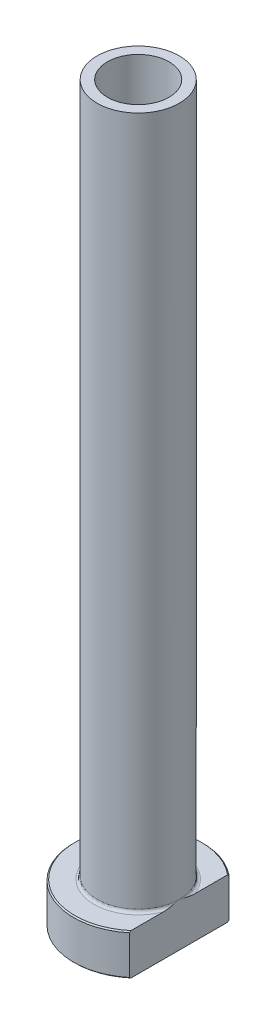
ISO-10303-21;
HEADER;
FILE_DESCRIPTION(('STEP AP214'),'2;1');
FILE_NAME('part.step','',(''),(''),'','','');
FILE_SCHEMA(('AUTOMOTIVE_DESIGN { 1 0 10303 214 1 1 1 1 }'));
ENDSEC;
DATA;
#1=APPLICATION_CONTEXT('core data for automotive mechanical design processes');
#2=APPLICATION_PROTOCOL_DEFINITION('international standard','automotive_design',2000,#1);
#3=PRODUCT_CONTEXT('',#1,'mechanical');
#4=PRODUCT('Part','Part','',(#3));
#5=PRODUCT_RELATED_PRODUCT_CATEGORY('part','',(#4));
#6=PRODUCT_DEFINITION_FORMATION('','',#4);
#7=PRODUCT_DEFINITION_CONTEXT('part definition',#1,'design');
#8=PRODUCT_DEFINITION('design','',#6,#7);
#9=PRODUCT_DEFINITION_SHAPE('','',#8);
#10=(LENGTH_UNIT() NAMED_UNIT(*) SI_UNIT(.MILLI.,.METRE.));
#11=(NAMED_UNIT(*) PLANE_ANGLE_UNIT() SI_UNIT($,.RADIAN.));
#12=(NAMED_UNIT(*) SI_UNIT($,.STERADIAN.) SOLID_ANGLE_UNIT());
#13=UNCERTAINTY_MEASURE_WITH_UNIT(LENGTH_MEASURE(1.E-05),#10,'distance_accuracy_value','');
#14=(GEOMETRIC_REPRESENTATION_CONTEXT(3) GLOBAL_UNCERTAINTY_ASSIGNED_CONTEXT((#13)) GLOBAL_UNIT_ASSIGNED_CONTEXT((#10,
#11,#12)) REPRESENTATION_CONTEXT('',''));
#15=CARTESIAN_POINT('',(0.,0.,0.));
#16=DIRECTION('',(0.,0.,1.));
#17=DIRECTION('',(1.,0.,0.));
#18=AXIS2_PLACEMENT_3D('',#15,#16,#17);
#19=CARTESIAN_POINT('',(0.,92.1876809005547,0.));
#20=DIRECTION('',(0.,1.,0.));
#21=DIRECTION('',(0.,0.,1.));
#22=AXIS2_PLACEMENT_3D('',#19,#20,#21);
#23=CYLINDRICAL_SURFACE('',#22,5.24999999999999);
#24=CARTESIAN_POINT('',(0.,125.,0.));
#25=DIRECTION('',(0.,1.,0.));
#26=DIRECTION('',(0.,0.,1.));
#27=AXIS2_PLACEMENT_3D('',#24,#25,#26);
#28=CIRCLE('',#27,5.24999999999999);
#29=CARTESIAN_POINT('',(0.,125.,5.24999999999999));
#30=VERTEX_POINT('',#29);
#31=EDGE_CURVE('E167',#30,#30,#28,.T.);
#32=ORIENTED_EDGE('',*,*,#31,.T.);
#33=EDGE_LOOP('',(#32));
#34=FACE_BOUND('',#33,.T.);
#35=CARTESIAN_POINT('',(0.,70.,0.));
#36=DIRECTION('',(0.,1.,0.));
#37=DIRECTION('',(0.,0.,1.));
#38=AXIS2_PLACEMENT_3D('',#35,#36,#37);
#39=CIRCLE('',#38,5.24999999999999);
#40=CARTESIAN_POINT('',(0.,70.,5.24999999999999));
#41=VERTEX_POINT('',#40);
#42=EDGE_CURVE('E170',#41,#41,#39,.T.);
#43=ORIENTED_EDGE('',*,*,#42,.F.);
#44=EDGE_LOOP('',(#43));
#45=FACE_BOUND('',#44,.T.);
#46=ADVANCED_FACE('F32',(#34,#45),#23,.F.);
#47=CARTESIAN_POINT('',(-5.24999999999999,125.,0.));
#48=DIRECTION('',(0.,1.,0.));
#49=DIRECTION('',(0.,0.,1.));
#50=AXIS2_PLACEMENT_3D('',#47,#48,#49);
#51=PLANE('',#50);
#52=CARTESIAN_POINT('',(0.,125.,0.));
#53=DIRECTION('',(0.,1.,0.));
#54=DIRECTION('',(0.,0.,1.));
#55=AXIS2_PLACEMENT_3D('',#52,#53,#54);
#56=CIRCLE('',#55,7.);
#57=CARTESIAN_POINT('',(0.,125.,7.));
#58=VERTEX_POINT('',#57);
#59=EDGE_CURVE('E174',#58,#58,#56,.T.);
#60=ORIENTED_EDGE('',*,*,#59,.T.);
#61=EDGE_LOOP('',(#60));
#62=FACE_BOUND('',#61,.T.);
#63=ORIENTED_EDGE('',*,*,#31,.F.);
#64=EDGE_LOOP('',(#63));
#65=FACE_BOUND('',#64,.T.);
#66=ADVANCED_FACE('F157',(#62,#65),#51,.T.);
#67=CARTESIAN_POINT('',(0.,92.1876809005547,0.));
#68=DIRECTION('',(0.,1.,0.));
#69=DIRECTION('',(0.,0.,1.));
#70=AXIS2_PLACEMENT_3D('',#67,#68,#69);
#71=CYLINDRICAL_SURFACE('',#70,7.);
#72=CARTESIAN_POINT('',(0.,7.50000000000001,0.));
#73=DIRECTION('',(0.,1.,0.));
#74=DIRECTION('',(0.,0.,1.));
#75=AXIS2_PLACEMENT_3D('',#72,#73,#74);
#76=CIRCLE('',#75,7.);
#77=CARTESIAN_POINT('',(7.,7.50000000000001,0.));
#78=VERTEX_POINT('',#77);
#79=EDGE_CURVE('E180',#78,#78,#76,.T.);
#80=ORIENTED_EDGE('',*,*,#79,.T.);
#81=EDGE_LOOP('',(#80));
#82=FACE_BOUND('',#81,.T.);
#83=ORIENTED_EDGE('',*,*,#59,.F.);
#84=EDGE_LOOP('',(#83));
#85=FACE_BOUND('',#84,.T.);
#86=ADVANCED_FACE('F162',(#82,#85),#71,.T.);
#87=CARTESIAN_POINT('',(-6.99999999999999,7.,0.));
#88=DIRECTION('',(0.,1.,0.));
#89=DIRECTION('',(0.,0.,1.));
#90=AXIS2_PLACEMENT_3D('',#87,#88,#89);
#91=PLANE('',#90);
#92=DIRECTION('',(0.,0.,1.));
#93=VECTOR('',#92,1.);
#94=CARTESIAN_POINT('',(6.99999999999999,7.,0.));
#95=LINE('',#94,#93);
#96=CARTESIAN_POINT('',(7.,7.,-8.22435407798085));
#97=VERTEX_POINT('',#96);
#98=CARTESIAN_POINT('',(6.99999999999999,7.,-2.69258240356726));
#99=VERTEX_POINT('',#98);
#100=EDGE_CURVE('E54',#97,#99,#95,.T.);
#101=ORIENTED_EDGE('',*,*,#100,.F.);
#102=CARTESIAN_POINT('',(0.,7.,0.));
#103=DIRECTION('',(0.,1.,0.));
#104=DIRECTION('',(0.,0.,1.));
#105=AXIS2_PLACEMENT_3D('',#102,#103,#104);
#106=CIRCLE('',#105,10.8);
#107=CARTESIAN_POINT('',(6.99999999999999,7.,8.22435407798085));
#108=VERTEX_POINT('',#107);
#109=EDGE_CURVE('E186',#97,#108,#106,.T.);
#110=ORIENTED_EDGE('',*,*,#109,.T.);
#111=CARTESIAN_POINT('',(6.99999999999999,7.,2.69258240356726));
#112=VERTEX_POINT('',#111);
#113=EDGE_CURVE('E134',#112,#108,#95,.T.);
#114=ORIENTED_EDGE('',*,*,#113,.F.);
#115=CARTESIAN_POINT('',(0.,7.,0.));
#116=DIRECTION('',(0.,1.,0.));
#117=DIRECTION('',(0.,0.,1.));
#118=AXIS2_PLACEMENT_3D('',#115,#116,#117);
#119=CIRCLE('',#118,7.5);
#120=EDGE_CURVE('E183',#112,#99,#119,.F.);
#121=ORIENTED_EDGE('',*,*,#120,.T.);
#122=EDGE_LOOP('',(#101,#110,#114,#121));
#123=FACE_BOUND('',#122,.T.);
#124=ADVANCED_FACE('F197',(#123),#91,.T.);
#125=CARTESIAN_POINT('',(0.,92.1876809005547,0.));
#126=DIRECTION('',(0.,1.,0.));
#127=DIRECTION('',(0.,0.,1.));
#128=AXIS2_PLACEMENT_3D('',#125,#126,#127);
#129=CYLINDRICAL_SURFACE('',#128,11.);
#130=DIRECTION('',(0.,-1.,0.));
#131=VECTOR('',#130,1.);
#132=CARTESIAN_POINT('',(6.99999999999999,125.,8.48528137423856));
#133=LINE('',#132,#131);
#134=CARTESIAN_POINT('',(6.99999999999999,6.80000000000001,8.48528137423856));
#135=VERTEX_POINT('',#134);
#136=CARTESIAN_POINT('',(6.99999999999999,0.200000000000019,8.48528137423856));
#137=VERTEX_POINT('',#136);
#138=EDGE_CURVE('E82',#135,#137,#133,.T.);
#139=ORIENTED_EDGE('',*,*,#138,.F.);
#140=CARTESIAN_POINT('',(0.,6.80000000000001,0.));
#141=DIRECTION('',(0.,1.,0.));
#142=DIRECTION('',(0.,0.,1.));
#143=AXIS2_PLACEMENT_3D('',#140,#141,#142);
#144=CIRCLE('',#143,11.);
#145=CARTESIAN_POINT('',(7.,6.80000000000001,-8.48528137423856));
#146=VERTEX_POINT('',#145);
#147=EDGE_CURVE('E95',#135,#146,#144,.F.);
#148=ORIENTED_EDGE('',*,*,#147,.T.);
#149=DIRECTION('',(0.,-1.,0.));
#150=VECTOR('',#149,1.);
#151=CARTESIAN_POINT('',(7.,125.,-8.48528137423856));
#152=LINE('',#151,#150);
#153=CARTESIAN_POINT('',(7.,0.20000000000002,-8.48528137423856));
#154=VERTEX_POINT('',#153);
#155=EDGE_CURVE('E192',#146,#154,#152,.T.);
#156=ORIENTED_EDGE('',*,*,#155,.T.);
#157=CARTESIAN_POINT('',(0.,0.20000000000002,0.));
#158=DIRECTION('',(0.,-1.,0.));
#159=DIRECTION('',(0.,0.,-1.));
#160=AXIS2_PLACEMENT_3D('',#157,#158,#159);
#161=CIRCLE('',#160,11.);
#162=EDGE_CURVE('E98',#154,#137,#161,.F.);
#163=ORIENTED_EDGE('',*,*,#162,.T.);
#164=EDGE_LOOP('',(#139,#148,#156,#163));
#165=FACE_BOUND('',#164,.T.);
#166=ADVANCED_FACE('F190',(#165),#129,.T.);
#167=CARTESIAN_POINT('',(-11.,0.,0.));
#168=DIRECTION('',(0.,-1.,0.));
#169=DIRECTION('',(0.,0.,-1.));
#170=AXIS2_PLACEMENT_3D('',#167,#168,#169);
#171=PLANE('',#170);
#172=CARTESIAN_POINT('',(0.,0.,0.));
#173=DIRECTION('',(0.,-1.,0.));
#174=DIRECTION('',(0.,0.,-1.));
#175=AXIS2_PLACEMENT_3D('',#172,#173,#174);
#176=CIRCLE('',#175,5.99999999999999);
#177=CARTESIAN_POINT('',(0.,0.,-5.99999999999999));
#178=VERTEX_POINT('',#177);
#179=EDGE_CURVE('E40',#178,#178,#176,.F.);
#180=ORIENTED_EDGE('',*,*,#179,.T.);
#181=EDGE_LOOP('',(#180));
#182=FACE_BOUND('',#181,.T.);
#183=DIRECTION('',(0.,0.,-1.));
#184=VECTOR('',#183,1.);
#185=CARTESIAN_POINT('',(6.99999999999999,0.,8.48528137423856));
#186=LINE('',#185,#184);
#187=CARTESIAN_POINT('',(6.99999999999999,0.,8.22435407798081));
#188=VERTEX_POINT('',#187);
#189=CARTESIAN_POINT('',(7.,0.,-8.22435407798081));
#190=VERTEX_POINT('',#189);
#191=EDGE_CURVE('E47',#188,#190,#186,.T.);
#192=ORIENTED_EDGE('',*,*,#191,.F.);
#193=CARTESIAN_POINT('',(0.,0.,0.));
#194=DIRECTION('',(0.,-1.,0.));
#195=DIRECTION('',(0.,0.,-1.));
#196=AXIS2_PLACEMENT_3D('',#193,#194,#195);
#197=CIRCLE('',#196,10.8);
#198=EDGE_CURVE('E92',#188,#190,#197,.T.);
#199=ORIENTED_EDGE('',*,*,#198,.T.);
#200=EDGE_LOOP('',(#192,#199));
#201=FACE_BOUND('',#200,.T.);
#202=ADVANCED_FACE('F91',(#182,#201),#171,.T.);
#203=CARTESIAN_POINT('',(0.,92.1876809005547,0.));
#204=DIRECTION('',(0.,1.,0.));
#205=DIRECTION('',(0.,0.,1.));
#206=AXIS2_PLACEMENT_3D('',#203,#204,#205);
#207=CYLINDRICAL_SURFACE('',#206,5.49999999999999);
#208=CARTESIAN_POINT('',(0.,0.499999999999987,0.));
#209=DIRECTION('',(0.,-1.,0.));
#210=DIRECTION('',(0.,0.,-1.));
#211=AXIS2_PLACEMENT_3D('',#208,#209,#210);
#212=CIRCLE('',#211,5.49999999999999);
#213=CARTESIAN_POINT('',(0.,0.499999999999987,-5.49999999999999));
#214=VERTEX_POINT('',#213);
#215=EDGE_CURVE('E11',#214,#214,#212,.T.);
#216=ORIENTED_EDGE('',*,*,#215,.T.);
#217=EDGE_LOOP('',(#216));
#218=FACE_BOUND('',#217,.T.);
#219=CARTESIAN_POINT('',(0.,58.,0.));
#220=DIRECTION('',(0.,1.,0.));
#221=DIRECTION('',(0.,0.,1.));
#222=AXIS2_PLACEMENT_3D('',#219,#220,#221);
#223=CIRCLE('',#222,5.5);
#224=CARTESIAN_POINT('',(0.,58.,5.5));
#225=VERTEX_POINT('',#224);
#226=EDGE_CURVE('E172',#225,#225,#223,.T.);
#227=ORIENTED_EDGE('',*,*,#226,.T.);
#228=EDGE_LOOP('',(#227));
#229=FACE_BOUND('',#228,.T.);
#230=ADVANCED_FACE('F215',(#218,#229),#207,.F.);
#231=CARTESIAN_POINT('',(0.,58.,0.));
#232=DIRECTION('',(0.,-1.,0.));
#233=DIRECTION('',(0.,0.,-1.));
#234=AXIS2_PLACEMENT_3D('',#231,#232,#233);
#235=CONICAL_SURFACE('',#234,5.5,0.0208303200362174);
#236=ORIENTED_EDGE('',*,*,#42,.T.);
#237=EDGE_LOOP('',(#236));
#238=FACE_BOUND('',#237,.T.);
#239=ORIENTED_EDGE('',*,*,#226,.F.);
#240=EDGE_LOOP('',(#239));
#241=FACE_BOUND('',#240,.T.);
#242=ADVANCED_FACE('F111',(#238,#241),#235,.F.);
#243=CARTESIAN_POINT('',(0.,7.50000000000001,0.));
#244=DIRECTION('',(0.,1.,0.));
#245=DIRECTION('',(0.,0.,1.));
#246=AXIS2_PLACEMENT_3D('',#243,#244,#245);
#247=TOROIDAL_SURFACE('',#246,7.5,0.5);
#248=ORIENTED_EDGE('',*,*,#120,.F.);
#249=CARTESIAN_POINT('',(7.,7.50000000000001,0.));
#250=CARTESIAN_POINT('',(7.,7.50000080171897,-1.25553870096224E-10));
#251=CARTESIAN_POINT('',(7.,7.50000160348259,2.90220272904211E-07));
#252=CARTESIAN_POINT('',(7.,7.50000310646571,1.10846441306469E-06));
#253=CARTESIAN_POINT('',(7.,7.50000379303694,1.65470112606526E-06));
#254=CARTESIAN_POINT('',(7.,7.50000521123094,2.96102753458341E-06));
#255=CARTESIAN_POINT('',(7.,7.50000592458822,3.7420417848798E-06));
#256=CARTESIAN_POINT('',(7.,7.50000721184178,5.36891875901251E-06));
#257=CARTESIAN_POINT('',(7.,7.50000778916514,6.21226347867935E-06));
#258=CARTESIAN_POINT('',(7.,7.50000990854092,9.4488970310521E-06));
#259=CARTESIAN_POINT('',(7.,7.50001133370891,1.19224913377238E-05));
#260=CARTESIAN_POINT('',(7.,7.50001370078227,1.68453048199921E-05));
#261=CARTESIAN_POINT('',(7.,7.50001467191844,1.92810862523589E-05));
#262=CARTESIAN_POINT('',(7.,7.50001870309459,2.95057524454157E-05));
#263=CARTESIAN_POINT('',(7.,7.50002167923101,3.73333819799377E-05));
#264=CARTESIAN_POINT('',(7.,7.50002610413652,5.21820411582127E-05));
#265=CARTESIAN_POINT('',(7.,7.50002771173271,5.91556013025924E-05));
#266=CARTESIAN_POINT('',(7.,7.50003935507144,0.000110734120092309));
#267=CARTESIAN_POINT('',(7.,7.50004810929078,0.000155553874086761));
#268=CARTESIAN_POINT('',(7.,7.50008643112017,0.000332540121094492));
#269=CARTESIAN_POINT('',(7.,7.50012307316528,0.000463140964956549));
#270=CARTESIAN_POINT('',(7.,7.50026565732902,0.000980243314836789));
#271=CARTESIAN_POINT('',(7.,7.50036696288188,0.00136762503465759));
#272=CARTESIAN_POINT('',(7.,7.50077257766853,0.00290683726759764));
#273=CARTESIAN_POINT('',(7.,7.50108269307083,0.00405753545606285));
#274=CARTESIAN_POINT('',(7.,7.50237341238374,0.0088598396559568));
#275=CARTESIAN_POINT('',(7.,7.50334676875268,0.0125128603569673));
#276=CARTESIAN_POINT('',(7.,7.51627189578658,0.061003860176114));
#277=CARTESIAN_POINT('',(7.,7.52827280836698,0.105832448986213));
#278=CARTESIAN_POINT('',(7.,7.55170994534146,0.193693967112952));
#279=CARTESIAN_POINT('',(7.,7.56314936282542,0.236726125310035));
#280=CARTESIAN_POINT('',(7.,7.5874041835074,0.328321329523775));
#281=CARTESIAN_POINT('',(7.,7.60020832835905,0.376887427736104));
#282=CARTESIAN_POINT('',(7.,7.62578161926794,0.474605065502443));
#283=CARTESIAN_POINT('',(7.,7.63854879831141,0.523757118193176));
#284=CARTESIAN_POINT('',(7.,7.66904753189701,0.642366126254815));
#285=CARTESIAN_POINT('',(7.,7.6866596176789,0.711854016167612));
#286=CARTESIAN_POINT('',(7.,7.72074501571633,0.849103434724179));
#287=CARTESIAN_POINT('',(7.,7.73723627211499,0.916860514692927));
#288=CARTESIAN_POINT('',(7.,7.79038156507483,1.14104210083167));
#289=CARTESIAN_POINT('',(7.,7.82528973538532,1.29788860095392));
#290=CARTESIAN_POINT('',(7.,7.88862298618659,1.61471917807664));
#291=CARTESIAN_POINT('',(7.,7.91697354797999,1.77471883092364));
#292=CARTESIAN_POINT('',(7.,7.95258292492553,2.02253505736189));
#293=CARTESIAN_POINT('',(7.,7.96355251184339,2.10981398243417));
#294=CARTESIAN_POINT('',(7.,7.98165287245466,2.28476193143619));
#295=CARTESIAN_POINT('',(7.,7.98878459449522,2.37243085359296));
#296=CARTESIAN_POINT('',(7.,7.99822919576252,2.54760327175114));
#297=CARTESIAN_POINT('',(7.,8.00056589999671,2.63510541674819));
#298=CARTESIAN_POINT('',(7.,7.99919996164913,2.81004074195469));
#299=CARTESIAN_POINT('',(7.,7.99550272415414,2.89747391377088));
#300=CARTESIAN_POINT('',(7.,7.98391011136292,3.0288207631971));
#301=CARTESIAN_POINT('',(7.,7.97897237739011,3.07299684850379));
#302=CARTESIAN_POINT('',(7.,7.96665453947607,3.16105400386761));
#303=CARTESIAN_POINT('',(7.,7.95927246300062,3.20493480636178));
#304=CARTESIAN_POINT('',(7.,7.94168688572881,3.29163191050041));
#305=CARTESIAN_POINT('',(7.,7.93151559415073,3.33445462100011));
#306=CARTESIAN_POINT('',(7.,7.90768392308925,3.41909658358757));
#307=CARTESIAN_POINT('',(7.,7.89402748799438,3.46091691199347));
#308=CARTESIAN_POINT('',(7.,7.86214701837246,3.54331777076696));
#309=CARTESIAN_POINT('',(7.,7.84387618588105,3.58388050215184));
#310=CARTESIAN_POINT('',(7.,7.80145892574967,3.66184445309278));
#311=CARTESIAN_POINT('',(7.,7.7773356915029,3.69925738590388));
#312=CARTESIAN_POINT('',(7.,7.73714014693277,3.74836513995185));
#313=CARTESIAN_POINT('',(7.,7.72423208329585,3.7626369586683));
#314=CARTESIAN_POINT('',(7.,7.69673765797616,3.78951670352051));
#315=CARTESIAN_POINT('',(7.,7.68215013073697,3.80212346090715));
#316=CARTESIAN_POINT('',(7.,7.65099843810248,3.82514624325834));
#317=CARTESIAN_POINT('',(7.,7.63441049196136,3.83553078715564));
#318=CARTESIAN_POINT('',(7.,7.5995579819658,3.85294010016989));
#319=CARTESIAN_POINT('',(7.,7.58129885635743,3.85997533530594));
#320=CARTESIAN_POINT('',(7.,7.54906837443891,3.86837810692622));
#321=CARTESIAN_POINT('',(7.,7.53536870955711,3.8707923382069));
#322=CARTESIAN_POINT('',(7.,7.50775756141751,3.87325240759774));
#323=CARTESIAN_POINT('',(7.,7.49384618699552,3.87329942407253));
#324=CARTESIAN_POINT('',(7.,7.46623771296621,3.87102093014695));
#325=CARTESIAN_POINT('',(7.,7.45254041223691,3.8686978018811));
#326=CARTESIAN_POINT('',(7.,7.42569741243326,3.86188775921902));
#327=CARTESIAN_POINT('',(7.,7.41255212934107,3.85739924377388));
#328=CARTESIAN_POINT('',(7.,7.38259319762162,3.84468786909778));
#329=CARTESIAN_POINT('',(7.,7.3661021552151,3.83570823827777));
#330=CARTESIAN_POINT('',(7.,7.33476729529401,3.81523202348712));
#331=CARTESIAN_POINT('',(7.,7.31992737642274,3.80372966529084));
#332=CARTESIAN_POINT('',(7.,7.28371925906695,3.77170797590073));
#333=CARTESIAN_POINT('',(7.,7.26356272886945,3.74983059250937));
#334=CARTESIAN_POINT('',(7.,7.22671696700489,3.70338283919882));
#335=CARTESIAN_POINT('',(7.,7.21003361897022,3.67880800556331));
#336=CARTESIAN_POINT('',(7.,7.1802655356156,3.62921731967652));
#337=CARTESIAN_POINT('',(7.,7.16704475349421,3.60428175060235));
#338=CARTESIAN_POINT('',(7.,7.14275069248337,3.55337478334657));
#339=CARTESIAN_POINT('',(7.,7.13167947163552,3.52740242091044));
#340=CARTESIAN_POINT('',(7.,7.10104499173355,3.44809573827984));
#341=CARTESIAN_POINT('',(7.,7.08424174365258,3.39369851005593));
#342=CARTESIAN_POINT('',(7.,7.05431378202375,3.27667221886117));
#343=CARTESIAN_POINT('',(7.,7.0419171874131,3.21386807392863));
#344=CARTESIAN_POINT('',(7.,7.0223460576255,3.08735184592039));
#345=CARTESIAN_POINT('',(7.,7.01518234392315,3.02363815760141));
#346=CARTESIAN_POINT('',(7.,7.00517826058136,2.89779001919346));
#347=CARTESIAN_POINT('',(7.,7.00221627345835,2.83566460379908));
#348=CARTESIAN_POINT('',(7.,6.99952325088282,2.7116062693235));
#349=CARTESIAN_POINT('',(7.,6.99977918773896,2.6496735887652));
#350=CARTESIAN_POINT('',(7.,7.00377761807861,2.49407814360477));
#351=CARTESIAN_POINT('',(7.,7.00924384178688,2.40046113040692));
#352=CARTESIAN_POINT('',(7.,7.0249410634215,2.21367396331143));
#353=CARTESIAN_POINT('',(7.,7.03517106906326,2.12050372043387));
#354=CARTESIAN_POINT('',(7.,7.05969765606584,1.93249035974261));
#355=CARTESIAN_POINT('',(7.,7.07408383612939,1.8376591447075));
#356=CARTESIAN_POINT('',(7.,7.10603300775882,1.6482934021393));
#357=CARTESIAN_POINT('',(7.,7.12360402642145,1.55376025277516));
#358=CARTESIAN_POINT('',(7.,7.16806468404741,1.33086107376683));
#359=CARTESIAN_POINT('',(7.,7.1960178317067,1.20270896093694));
#360=CARTESIAN_POINT('',(7.,7.25475947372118,0.948586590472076));
#361=CARTESIAN_POINT('',(7.,7.28551257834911,0.82260799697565));
#362=CARTESIAN_POINT('',(7.,7.33123897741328,0.641334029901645));
#363=CARTESIAN_POINT('',(7.,7.34543722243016,0.58584061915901));
#364=CARTESIAN_POINT('',(7.,7.37418243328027,0.474686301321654));
#365=CARTESIAN_POINT('',(7.,7.38873064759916,0.419025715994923));
#366=CARTESIAN_POINT('',(7.,7.41873357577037,0.305011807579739));
#367=CARTESIAN_POINT('',(7.,7.43419762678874,0.246660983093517));
#368=CARTESIAN_POINT('',(7.,7.46502361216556,0.130933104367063));
#369=CARTESIAN_POINT('',(7.,7.48038319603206,0.0735554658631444));
#370=CARTESIAN_POINT('',(7.,7.49665455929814,0.0125077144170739));
#371=CARTESIAN_POINT('',(7.,7.49762931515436,0.00884956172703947));
#372=CARTESIAN_POINT('',(7.,7.49892036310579,0.0040460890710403));
#373=CARTESIAN_POINT('',(7.,7.49922940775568,0.00289935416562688));
#374=CARTESIAN_POINT('',(7.,7.49963371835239,0.00136508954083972));
#375=CARTESIAN_POINT('',(7.,7.499734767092,0.000978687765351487));
#376=CARTESIAN_POINT('',(7.,7.49987704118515,0.00046273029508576));
#377=CARTESIAN_POINT('',(7.,7.49991363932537,0.000332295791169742));
#378=CARTESIAN_POINT('',(7.,7.49995192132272,0.000155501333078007));
#379=CARTESIAN_POINT('',(7.,7.49996067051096,0.000110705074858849));
#380=CARTESIAN_POINT('',(7.,7.49997230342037,5.91504855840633E-05));
#381=CARTESIAN_POINT('',(7.,7.49997390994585,5.21782459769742E-05));
#382=CARTESIAN_POINT('',(7.,7.4999783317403,3.73322807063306E-05));
#383=CARTESIAN_POINT('',(7.,7.4999813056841,2.95059544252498E-05));
#384=CARTESIAN_POINT('',(7.,7.49998533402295,1.92826350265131E-05));
#385=CARTESIAN_POINT('',(7.,7.49998630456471,1.68469523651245E-05));
#386=CARTESIAN_POINT('',(7.,7.49998867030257,1.19242372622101E-05));
#387=CARTESIAN_POINT('',(7.,7.49999009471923,9.45063049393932E-06));
#388=CARTESIAN_POINT('',(7.,7.49999221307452,6.21386443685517E-06));
#389=CARTESIAN_POINT('',(7.,7.49999279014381,5.37045304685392E-06));
#390=CARTESIAN_POINT('',(7.,7.49999407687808,3.74339687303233E-06));
#391=CARTESIAN_POINT('',(7.,7.49999478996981,2.96226854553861E-06));
#392=CARTESIAN_POINT('',(7.,7.49999620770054,1.65567341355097E-06));
#393=CARTESIAN_POINT('',(7.,7.49999689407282,1.10929189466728E-06));
#394=CARTESIAN_POINT('',(7.,7.49999839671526,2.9068315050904E-07));
#395=CARTESIAN_POINT('',(7.,7.49999919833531,1.25546802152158E-10));
#396=CARTESIAN_POINT('',(7.,7.50000000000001,0.));
#397=B_SPLINE_CURVE_WITH_KNOTS('',3,(#249,#250,#251,#252,#253,#254,#255,#256,#257,#258,#259,
#260,#261,#262,#263,#264,#265,#266,#267,#268,#269,#270,#271,#272,#273,#274,#275,#276,#277,#278,
#279,#280,#281,#282,#283,#284,#285,#286,#287,#288,#289,#290,#291,#292,#293,#294,#295,#296,#297,
#298,#299,#300,#301,#302,#303,#304,#305,#306,#307,#308,#309,#310,#311,#312,#313,#314,#315,#316,
#317,#318,#319,#320,#321,#322,#323,#324,#325,#326,#327,#328,#329,#330,#331,#332,#333,#334,#335,
#336,#337,#338,#339,#340,#341,#342,#343,#344,#345,#346,#347,#348,#349,#350,#351,#352,#353,#354,
#355,#356,#357,#358,#359,#360,#361,#362,#363,#364,#365,#366,#367,#368,#369,#370,#371,#372,#373,
#374,#375,#376,#377,#378,#379,#380,#381,#382,#383,#384,#385,#386,#387,#388,#389,#390,#391,#392,
#393,#394,#395,#396),.UNSPECIFIED.,.T.,.F.,(4,2,2,2,2,2,2,2,2,2,2,2,2,2,2,2,2,2,2,2,2,2,2,2,2,2,
2,2,2,2,2,2,2,2,2,2,2,2,2,2,2,2,2,2,2,2,2,2,2,2,2,2,2,2,2,2,2,2,2,2,2,2,2,2,2,2,2,2,2,2,2,2,2,
4),(0.,2.42201439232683E-06,5.0530489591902E-06,8.20814149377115E-06,1.12722937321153E-05,
1.98044023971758E-05,2.76642073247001E-05,5.27403854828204E-05,7.41830797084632E-05,
0.000211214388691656,0.000617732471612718,0.00181938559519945,0.00539412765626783,
0.0167361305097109,0.155952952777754,0.289534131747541,0.440210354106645,0.592559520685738,
0.80761174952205,1.01681499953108,1.49878389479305,1.98598665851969,2.24981935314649,
2.51358682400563,2.77604050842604,3.03825922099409,3.17156039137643,3.30496939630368,
3.43689837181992,3.56867869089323,3.70185328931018,3.83450849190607,3.89212877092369,
3.94978928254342,4.00821928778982,4.06646549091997,4.10801107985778,4.14953598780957,
4.19101920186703,4.23253313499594,4.28854866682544,4.34469377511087,4.43343413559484,
4.52232362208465,4.60686785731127,4.69149264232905,4.86185145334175,5.05362927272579,
5.24580256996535,5.43229132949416,5.6180253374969,5.89918385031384,6.18028382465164,
6.46796485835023,6.75638131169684,7.14981284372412,7.53882346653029,7.71066604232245,
7.88325629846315,8.06435328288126,8.24254095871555,8.25389891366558,8.25746134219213,
8.25865995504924,8.25906595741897,8.25920291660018,8.2592243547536,8.25924942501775,
8.25925728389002,8.25926581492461,8.25926887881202,8.25927203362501,8.25927466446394,
8.25927708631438),.UNSPECIFIED.);
#398=EDGE_CURVE('E126',#112,#78,#397,.T.);
#399=ORIENTED_EDGE('',*,*,#398,.T.);
#400=ORIENTED_EDGE('',*,*,#79,.F.);
#401=CARTESIAN_POINT('',(7.,7.50000000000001,0.));
#402=CARTESIAN_POINT('',(7.,7.49999919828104,1.25555284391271E-10));
#403=CARTESIAN_POINT('',(7.,7.49999839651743,-2.90220271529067E-07));
#404=CARTESIAN_POINT('',(7.,7.4999968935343,-1.10846441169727E-06));
#405=CARTESIAN_POINT('',(7.,7.49999620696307,-1.65470112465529E-06));
#406=CARTESIAN_POINT('',(7.,7.49999478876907,-2.96102753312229E-06));
#407=CARTESIAN_POINT('',(7.,7.49999407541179,-3.74204178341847E-06));
#408=CARTESIAN_POINT('',(7.,7.49999278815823,-5.36891875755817E-06));
#409=CARTESIAN_POINT('',(7.,7.49999221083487,-6.21226347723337E-06));
#410=CARTESIAN_POINT('',(7.,7.49999009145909,-9.44889702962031E-06));
#411=CARTESIAN_POINT('',(7.,7.49998866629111,-1.19224913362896E-05));
#412=CARTESIAN_POINT('',(7.,7.49998629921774,-1.68453048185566E-05));
#413=CARTESIAN_POINT('',(7.,7.49998532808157,-1.92810862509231E-05));
#414=CARTESIAN_POINT('',(7.,7.49998129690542,-2.95057524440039E-05));
#415=CARTESIAN_POINT('',(6.99999999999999,7.499978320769,-3.73333819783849E-05));
#416=CARTESIAN_POINT('',(6.99999999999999,7.49997389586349,-5.21820411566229E-05));
#417=CARTESIAN_POINT('',(6.99999999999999,7.49997228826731,-5.91556013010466E-05));
#418=CARTESIAN_POINT('',(7.,7.49996064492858,-0.000110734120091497));
#419=CARTESIAN_POINT('',(7.,7.49995189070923,-0.000155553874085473));
#420=CARTESIAN_POINT('',(6.99999999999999,7.49991356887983,-0.000332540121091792));
#421=CARTESIAN_POINT('',(6.99999999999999,7.49987692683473,-0.000463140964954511));
#422=CARTESIAN_POINT('',(7.,7.499734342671,-0.000980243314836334));
#423=CARTESIAN_POINT('',(7.,7.49963303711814,-0.00136762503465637));
#424=CARTESIAN_POINT('',(6.99999999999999,7.49922742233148,-0.00290683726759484));
#425=CARTESIAN_POINT('',(6.99999999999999,7.49891730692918,-0.00405753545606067));
#426=CARTESIAN_POINT('',(7.00000000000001,7.49762658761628,-0.00885983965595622));
#427=CARTESIAN_POINT('',(7.,7.49665323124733,-0.0125128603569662));
#428=CARTESIAN_POINT('',(6.99999999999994,7.48372810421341,-0.0610038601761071));
#429=CARTESIAN_POINT('',(6.99999999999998,7.47172719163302,-0.10583244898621));
#430=CARTESIAN_POINT('',(7.00000000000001,7.44829005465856,-0.193693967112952));
#431=CARTESIAN_POINT('',(7.,7.43685063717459,-0.236726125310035));
#432=CARTESIAN_POINT('',(6.99999999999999,7.41259581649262,-0.328321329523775));
#433=CARTESIAN_POINT('',(6.99999999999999,7.39979167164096,-0.376887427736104));
#434=CARTESIAN_POINT('',(7.,7.37421838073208,-0.474605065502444));
#435=CARTESIAN_POINT('',(7.,7.36145120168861,-0.523757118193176));
#436=CARTESIAN_POINT('',(6.99999999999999,7.330952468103,-0.642366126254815));
#437=CARTESIAN_POINT('',(7.,7.31334038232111,-0.711854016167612));
#438=CARTESIAN_POINT('',(7.,7.27925498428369,-0.849103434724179));
#439=CARTESIAN_POINT('',(7.,7.26276372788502,-0.916860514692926));
#440=CARTESIAN_POINT('',(7.,7.20961843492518,-1.14104210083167));
#441=CARTESIAN_POINT('',(7.,7.17471026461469,-1.29788860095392));
#442=CARTESIAN_POINT('',(7.,7.11137701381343,-1.61471917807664));
#443=CARTESIAN_POINT('',(7.,7.08302645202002,-1.77471883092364));
#444=CARTESIAN_POINT('',(7.,7.04741707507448,-2.02253505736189));
#445=CARTESIAN_POINT('',(7.,7.03644748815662,-2.10981398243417));
#446=CARTESIAN_POINT('',(7.,7.01834712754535,-2.28476193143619));
#447=CARTESIAN_POINT('',(7.,7.01121540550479,-2.37243085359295));
#448=CARTESIAN_POINT('',(7.,7.0017708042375,-2.54760327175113));
#449=CARTESIAN_POINT('',(7.,6.99943410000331,-2.63510541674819));
#450=CARTESIAN_POINT('',(7.,7.00080003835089,-2.81004074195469));
#451=CARTESIAN_POINT('',(7.,7.00449727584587,-2.89747391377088));
#452=CARTESIAN_POINT('',(7.,7.0160898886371,-3.0288207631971));
#453=CARTESIAN_POINT('',(7.,7.0210276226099,-3.07299684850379));
#454=CARTESIAN_POINT('',(7.,7.03334546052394,-3.16105400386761));
#455=CARTESIAN_POINT('',(7.,7.0407275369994,-3.20493480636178));
#456=CARTESIAN_POINT('',(7.,7.0583131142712,-3.29163191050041));
#457=CARTESIAN_POINT('',(7.,7.06848440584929,-3.33445462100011));
#458=CARTESIAN_POINT('',(7.,7.09231607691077,-3.41909658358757));
#459=CARTESIAN_POINT('',(7.,7.10597251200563,-3.46091691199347));
#460=CARTESIAN_POINT('',(7.,7.13785298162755,-3.54331777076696));
#461=CARTESIAN_POINT('',(7.,7.15612381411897,-3.58388050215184));
#462=CARTESIAN_POINT('',(7.,7.19854107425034,-3.66184445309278));
#463=CARTESIAN_POINT('',(7.,7.22266430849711,-3.69925738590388));
#464=CARTESIAN_POINT('',(7.,7.26285985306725,-3.74836513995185));
#465=CARTESIAN_POINT('',(7.,7.27576791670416,-3.76263695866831));
#466=CARTESIAN_POINT('',(7.,7.30326234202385,-3.78951670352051));
#467=CARTESIAN_POINT('',(7.,7.31784986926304,-3.80212346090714));
#468=CARTESIAN_POINT('',(7.,7.34900156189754,-3.82514624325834));
#469=CARTESIAN_POINT('',(7.,7.36558950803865,-3.83553078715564));
#470=CARTESIAN_POINT('',(7.,7.40044201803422,-3.85294010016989));
#471=CARTESIAN_POINT('',(7.,7.41870114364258,-3.85997533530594));
#472=CARTESIAN_POINT('',(7.,7.45093162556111,-3.86837810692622));
#473=CARTESIAN_POINT('',(7.,7.4646312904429,-3.8707923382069));
#474=CARTESIAN_POINT('',(7.,7.49224243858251,-3.87325240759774));
#475=CARTESIAN_POINT('',(7.,7.5061538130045,-3.87329942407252));
#476=CARTESIAN_POINT('',(7.,7.5337622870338,-3.87102093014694));
#477=CARTESIAN_POINT('',(7.,7.5474595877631,-3.8686978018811));
#478=CARTESIAN_POINT('',(7.,7.57430258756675,-3.86188775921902));
#479=CARTESIAN_POINT('',(7.,7.58744787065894,-3.85739924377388));
#480=CARTESIAN_POINT('',(7.,7.61740680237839,-3.84468786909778));
#481=CARTESIAN_POINT('',(7.,7.63389784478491,-3.83570823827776));
#482=CARTESIAN_POINT('',(7.,7.665232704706,-3.81523202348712));
#483=CARTESIAN_POINT('',(7.,7.68007262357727,-3.80372966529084));
#484=CARTESIAN_POINT('',(7.,7.71628074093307,-3.77170797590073));
#485=CARTESIAN_POINT('',(7.,7.73643727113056,-3.74983059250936));
#486=CARTESIAN_POINT('',(7.,7.77328303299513,-3.70338283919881));
#487=CARTESIAN_POINT('',(7.,7.78996638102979,-3.67880800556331));
#488=CARTESIAN_POINT('',(7.,7.81973446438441,-3.62921731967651));
#489=CARTESIAN_POINT('',(7.,7.8329552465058,-3.60428175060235));
#490=CARTESIAN_POINT('',(7.,7.85724930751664,-3.55337478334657));
#491=CARTESIAN_POINT('',(7.,7.86832052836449,-3.52740242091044));
#492=CARTESIAN_POINT('',(7.,7.89895500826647,-3.44809573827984));
#493=CARTESIAN_POINT('',(7.,7.91575825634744,-3.39369851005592));
#494=CARTESIAN_POINT('',(7.,7.94568621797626,-3.27667221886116));
#495=CARTESIAN_POINT('',(7.,7.95808281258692,-3.21386807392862));
#496=CARTESIAN_POINT('',(7.,7.97765394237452,-3.08735184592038));
#497=CARTESIAN_POINT('',(7.,7.98481765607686,-3.0236381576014));
#498=CARTESIAN_POINT('',(7.,7.99482173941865,-2.89779001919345));
#499=CARTESIAN_POINT('',(7.,7.99778372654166,-2.83566460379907));
#500=CARTESIAN_POINT('',(7.,8.00047674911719,-2.71160626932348));
#501=CARTESIAN_POINT('',(7.,8.00022081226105,-2.64967358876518));
#502=CARTESIAN_POINT('',(7.,7.9962223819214,-2.49407814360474));
#503=CARTESIAN_POINT('',(7.,7.99075615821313,-2.4004611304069));
#504=CARTESIAN_POINT('',(7.,7.97505893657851,-2.21367396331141));
#505=CARTESIAN_POINT('',(7.,7.96482893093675,-2.12050372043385));
#506=CARTESIAN_POINT('',(7.,7.94030234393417,-1.93249035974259));
#507=CARTESIAN_POINT('',(7.,7.92591616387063,-1.83765914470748));
#508=CARTESIAN_POINT('',(7.,7.89396699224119,-1.64829340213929));
#509=CARTESIAN_POINT('',(7.,7.87639597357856,-1.55376025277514));
#510=CARTESIAN_POINT('',(7.,7.83193531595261,-1.33086107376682));
#511=CARTESIAN_POINT('',(7.,7.80398216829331,-1.20270896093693));
#512=CARTESIAN_POINT('',(7.,7.74524052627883,-0.94858659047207));
#513=CARTESIAN_POINT('',(7.,7.71448742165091,-0.822607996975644));
#514=CARTESIAN_POINT('',(7.,7.66876102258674,-0.641334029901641));
#515=CARTESIAN_POINT('',(7.,7.65456277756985,-0.585840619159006));
#516=CARTESIAN_POINT('',(7.,7.62581756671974,-0.474686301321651));
#517=CARTESIAN_POINT('',(7.,7.61126935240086,-0.41902571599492));
#518=CARTESIAN_POINT('',(7.,7.58126642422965,-0.305011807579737));
#519=CARTESIAN_POINT('',(7.,7.56580237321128,-0.246660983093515));
#520=CARTESIAN_POINT('',(7.,7.53497638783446,-0.130933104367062));
#521=CARTESIAN_POINT('',(7.,7.51961680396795,-0.0735554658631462));
#522=CARTESIAN_POINT('',(7.,7.50334544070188,-0.0125077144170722));
#523=CARTESIAN_POINT('',(7.,7.50237068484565,-0.00884956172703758));
#524=CARTESIAN_POINT('',(7.,7.50107963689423,-0.00404608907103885));
#525=CARTESIAN_POINT('',(7.,7.50077059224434,-0.00289935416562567));
#526=CARTESIAN_POINT('',(7.,7.50036628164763,-0.0013650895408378));
#527=CARTESIAN_POINT('',(7.,7.50026523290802,-0.000978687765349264));
#528=CARTESIAN_POINT('',(7.,7.50012295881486,-0.000462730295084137));
#529=CARTESIAN_POINT('',(7.,7.50008636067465,-0.000332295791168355));
#530=CARTESIAN_POINT('',(7.,7.50004807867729,-0.000155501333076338));
#531=CARTESIAN_POINT('',(7.,7.50003932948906,-0.000110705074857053));
#532=CARTESIAN_POINT('',(7.,7.50002769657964,-5.91504855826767E-05));
#533=CARTESIAN_POINT('',(7.,7.50002609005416,-5.2178245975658E-05));
#534=CARTESIAN_POINT('',(7.,7.50002166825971,-3.7332280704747E-05));
#535=CARTESIAN_POINT('',(7.,7.50001869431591,-2.95059544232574E-05));
#536=CARTESIAN_POINT('',(7.,7.50001466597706,-1.92826350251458E-05));
#537=CARTESIAN_POINT('',(7.,7.5000136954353,-1.68469523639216E-05));
#538=CARTESIAN_POINT('',(7.,7.50001132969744,-1.1924237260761E-05));
#539=CARTESIAN_POINT('',(7.,7.50000990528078,-9.45063049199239E-06));
#540=CARTESIAN_POINT('',(7.,7.50000778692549,-6.21386443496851E-06));
#541=CARTESIAN_POINT('',(7.,7.5000072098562,-5.37045304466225E-06));
#542=CARTESIAN_POINT('',(7.,7.50000592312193,-3.74339687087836E-06));
#543=CARTESIAN_POINT('',(6.99999999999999,7.5000052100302,-2.96226854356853E-06));
#544=CARTESIAN_POINT('',(7.,7.50000379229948,-1.65567341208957E-06));
#545=CARTESIAN_POINT('',(7.,7.50000310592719,-1.10929189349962E-06));
#546=CARTESIAN_POINT('',(7.,7.50000160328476,-2.90683149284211E-07));
#547=CARTESIAN_POINT('',(7.,7.5000008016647,-1.25545354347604E-10));
#548=CARTESIAN_POINT('',(7.,7.50000000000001,0.));
#549=B_SPLINE_CURVE_WITH_KNOTS('',3,(#401,#402,#403,#404,#405,#406,#407,#408,#409,#410,#411,
#412,#413,#414,#415,#416,#417,#418,#419,#420,#421,#422,#423,#424,#425,#426,#427,#428,#429,#430,
#431,#432,#433,#434,#435,#436,#437,#438,#439,#440,#441,#442,#443,#444,#445,#446,#447,#448,#449,
#450,#451,#452,#453,#454,#455,#456,#457,#458,#459,#460,#461,#462,#463,#464,#465,#466,#467,#468,
#469,#470,#471,#472,#473,#474,#475,#476,#477,#478,#479,#480,#481,#482,#483,#484,#485,#486,#487,
#488,#489,#490,#491,#492,#493,#494,#495,#496,#497,#498,#499,#500,#501,#502,#503,#504,#505,#506,
#507,#508,#509,#510,#511,#512,#513,#514,#515,#516,#517,#518,#519,#520,#521,#522,#523,#524,#525,
#526,#527,#528,#529,#530,#531,#532,#533,#534,#535,#536,#537,#538,#539,#540,#541,#542,#543,#544,
#545,#546,#547,#548),.UNSPECIFIED.,.T.,.F.,(4,2,2,2,2,2,2,2,2,2,2,2,2,2,2,2,2,2,2,2,2,2,2,2,2,2,
2,2,2,2,2,2,2,2,2,2,2,2,2,2,2,2,2,2,2,2,2,2,2,2,2,2,2,2,2,2,2,2,2,2,2,2,2,2,2,2,2,2,2,2,2,2,2,
4),(0.,2.42201439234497E-06,5.05304895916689E-06,8.20814149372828E-06,1.12722937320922E-05,
1.98044023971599E-05,2.76642073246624E-05,5.27403854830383E-05,7.41830797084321E-05,
0.000211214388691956,0.000617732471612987,0.00181938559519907,0.00539412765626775,
0.0167361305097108,0.155952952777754,0.289534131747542,0.440210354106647,0.59255952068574,
0.807611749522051,1.01681499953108,1.49878389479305,1.98598665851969,2.24981935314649,
2.51358682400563,2.77604050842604,3.0382592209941,3.17156039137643,3.30496939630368,
3.43689837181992,3.56867869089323,3.70185328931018,3.83450849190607,3.89212877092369,
3.94978928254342,4.00821928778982,4.06646549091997,4.10801107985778,4.14953598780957,
4.19101920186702,4.23253313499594,4.28854866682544,4.34469377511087,4.43343413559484,
4.52232362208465,4.60686785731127,4.69149264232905,4.86185145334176,5.0536292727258,
5.24580256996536,5.43229132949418,5.61802533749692,5.89918385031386,6.18028382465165,
6.46796485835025,6.75638131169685,7.14981284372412,7.5388234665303,7.71066604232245,
7.88325629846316,8.06435328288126,8.24254095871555,8.25389891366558,8.25746134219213,
8.25865995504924,8.25906595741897,8.25920291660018,8.2592243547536,8.25924942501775,
8.25925728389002,8.25926581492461,8.25926887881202,8.25927203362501,8.25927466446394,
8.25927708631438),.UNSPECIFIED.);
#550=EDGE_CURVE('E135',#78,#99,#549,.T.);
#551=ORIENTED_EDGE('',*,*,#550,.T.);
#552=EDGE_LOOP('',(#248,#399,#400,#551));
#553=FACE_BOUND('',#552,.T.);
#554=ADVANCED_FACE('F141',(#553),#247,.F.);
#555=CARTESIAN_POINT('',(0.,7.00000000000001,0.));
#556=DIRECTION('',(0.,-1.,0.));
#557=DIRECTION('',(0.,0.,-1.));
#558=AXIS2_PLACEMENT_3D('',#555,#556,#557);
#559=CONICAL_SURFACE('',#558,10.8,0.785398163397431);
#560=CARTESIAN_POINT('',(7.,-2.13774979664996,-18.6685261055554));
#561=CARTESIAN_POINT('',(7.,-1.86574872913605,-18.3780244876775));
#562=CARTESIAN_POINT('',(7.,-1.59415659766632,-18.0871392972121));
#563=CARTESIAN_POINT('',(7.,-1.0519287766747,-17.5044755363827));
#564=CARTESIAN_POINT('',(7.,-0.781293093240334,-17.2126969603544));
#565=CARTESIAN_POINT('',(7.,-0.241050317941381,-16.628048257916));
#566=CARTESIAN_POINT('',(7.,0.0285564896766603,-16.3351778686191));
#567=CARTESIAN_POINT('',(7.,0.566485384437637,-15.7482616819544));
#568=CARTESIAN_POINT('',(7.,0.834807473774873,-15.4542158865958));
#569=CARTESIAN_POINT('',(7.,1.64198377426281,-14.5651645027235));
#570=CARTESIAN_POINT('',(7.,2.17856420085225,-13.9680841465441));
#571=CARTESIAN_POINT('',(7.,2.97696333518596,-13.0668144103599));
#572=CARTESIAN_POINT('',(7.,3.24199785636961,-12.7654727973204));
#573=CARTESIAN_POINT('',(7.,3.76945856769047,-12.1605141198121));
#574=CARTESIAN_POINT('',(7.,4.03188476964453,-11.856897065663));
#575=CARTESIAN_POINT('',(7.,4.50733797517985,-11.3009625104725));
#576=CARTESIAN_POINT('',(7.,4.72088020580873,-11.0490858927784));
#577=CARTESIAN_POINT('',(7.,5.14538078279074,-10.5431655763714));
#578=CARTESIAN_POINT('',(7.,5.3563391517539,-10.2891218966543));
#579=CARTESIAN_POINT('',(7.,5.77522964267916,-9.77836737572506));
#580=CARTESIAN_POINT('',(7.,5.98316044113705,-9.5216554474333));
#581=CARTESIAN_POINT('',(7.,6.39521098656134,-9.00519084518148));
#582=CARTESIAN_POINT('',(7.,6.59933078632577,-8.74543821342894));
#583=CARTESIAN_POINT('',(7.,7.00243445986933,-8.22283607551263));
#584=CARTESIAN_POINT('',(7.,7.20142819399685,-7.95999419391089));
#585=CARTESIAN_POINT('',(7.,7.59353840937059,-7.42991856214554));
#586=CARTESIAN_POINT('',(7.,7.78665447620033,-7.16268450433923));
#587=CARTESIAN_POINT('',(7.,8.16523718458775,-6.62311113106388));
#588=CARTESIAN_POINT('',(7.,8.3507091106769,-6.35077553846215));
#589=CARTESIAN_POINT('',(7.,8.71189725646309,-5.79973731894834));
#590=CARTESIAN_POINT('',(7.,8.88761537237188,-5.52103594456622));
#591=CARTESIAN_POINT('',(7.,9.19554959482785,-5.00707921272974));
#592=CARTESIAN_POINT('',(7.,9.32988075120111,-4.77309669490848));
#593=CARTESIAN_POINT('',(7.,9.58764253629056,-4.29911523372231));
#594=CARTESIAN_POINT('',(7.,9.71107181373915,-4.05911554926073));
#595=CARTESIAN_POINT('',(7.,9.94390907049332,-3.57263619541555));
#596=CARTESIAN_POINT('',(7.,10.0533307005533,-3.32616312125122));
#597=CARTESIAN_POINT('',(7.,10.2545146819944,-2.82607166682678));
#598=CARTESIAN_POINT('',(7.,10.3462820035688,-2.57245532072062));
#599=CARTESIAN_POINT('',(7.,10.4907049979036,-2.11254447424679));
#600=CARTESIAN_POINT('',(7.,10.5475277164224,-1.90756611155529));
#601=CARTESIAN_POINT('',(7.,10.6452043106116,-1.49381161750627));
#602=CARTESIAN_POINT('',(7.,10.68606033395,-1.28503600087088));
#603=CARTESIAN_POINT('',(7.,10.749755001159,-0.865342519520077));
#604=CARTESIAN_POINT('',(7.,10.772646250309,-0.654432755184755));
#605=CARTESIAN_POINT('',(7.,10.7993569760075,-0.231396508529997));
#606=CARTESIAN_POINT('',(7.,10.8031771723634,-0.0192700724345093));
#607=CARTESIAN_POINT('',(7.,10.791517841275,0.404715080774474));
#608=CARTESIAN_POINT('',(7.,10.7760135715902,0.616573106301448));
#609=CARTESIAN_POINT('',(7.,10.726541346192,1.03810446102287));
#610=CARTESIAN_POINT('',(7.,10.692571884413,1.24777761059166));
#611=CARTESIAN_POINT('',(7.,10.6077703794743,1.66430273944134));
#612=CARTESIAN_POINT('',(7.,10.5568873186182,1.87114418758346));
#613=CARTESIAN_POINT('',(7.,10.4404729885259,2.2806127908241));
#614=CARTESIAN_POINT('',(7.,10.3749414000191,2.48323985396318));
#615=CARTESIAN_POINT('',(7.,10.2190980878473,2.91860265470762));
#616=CARTESIAN_POINT('',(7.,10.126461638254,3.15050038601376));
#617=CARTESIAN_POINT('',(7.,9.92740958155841,3.6083545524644));
#618=CARTESIAN_POINT('',(7.,9.82098769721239,3.83430822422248));
#619=CARTESIAN_POINT('',(7.,9.59695142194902,4.28105341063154));
#620=CARTESIAN_POINT('',(6.99999999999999,9.47931762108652,4.50183511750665));
#621=CARTESIAN_POINT('',(6.99999999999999,9.23524231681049,4.93840249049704));
#622=CARTESIAN_POINT('',(6.99999999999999,9.10880204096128,5.15418884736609));
#623=CARTESIAN_POINT('',(6.99999999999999,8.84714657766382,5.58417945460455));
#624=CARTESIAN_POINT('',(6.99999999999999,8.71183920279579,5.798327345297));
#625=CARTESIAN_POINT('',(6.99999999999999,8.43533082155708,6.22277635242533));
#626=CARTESIAN_POINT('',(6.99999999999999,8.29412966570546,6.43307737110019));
#627=CARTESIAN_POINT('',(6.99999999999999,8.00706556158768,6.85014007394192));
#628=CARTESIAN_POINT('',(6.99999999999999,7.86120763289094,7.05690522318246));
#629=CARTESIAN_POINT('',(6.99999999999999,7.56553131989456,7.46757278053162));
#630=CARTESIAN_POINT('',(6.99999999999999,7.41571298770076,7.67147522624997));
#631=CARTESIAN_POINT('',(6.99999999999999,7.07999705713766,8.12067189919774));
#632=CARTESIAN_POINT('',(6.99999999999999,6.89330819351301,8.3653740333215));
#633=CARTESIAN_POINT('',(6.99999999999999,6.5159718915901,8.85171196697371));
#634=CARTESIAN_POINT('',(6.99999999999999,6.32532432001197,9.09334766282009));
#635=CARTESIAN_POINT('',(6.99999999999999,5.94076020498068,9.57404667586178));
#636=CARTESIAN_POINT('',(6.99999999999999,5.74684327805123,9.81310968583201));
#637=CARTESIAN_POINT('',(6.99999999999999,5.35630729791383,10.2890203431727));
#638=CARTESIAN_POINT('',(6.99999999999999,5.15968820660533,10.5258679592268));
#639=CARTESIAN_POINT('',(6.99999999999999,4.56606953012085,11.2340330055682));
#640=CARTESIAN_POINT('',(6.99999999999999,4.1656814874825,11.7025100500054));
#641=CARTESIAN_POINT('',(6.99999999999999,3.35840033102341,12.6338245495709));
#642=CARTESIAN_POINT('',(6.99999999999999,2.95150704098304,13.0966618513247));
#643=CARTESIAN_POINT('',(6.99999999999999,2.35017562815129,13.773410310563));
#644=CARTESIAN_POINT('',(6.99999999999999,2.15763812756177,13.9890143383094));
#645=CARTESIAN_POINT('',(6.99999999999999,1.77161609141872,14.4193671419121));
#646=CARTESIAN_POINT('',(6.99999999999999,1.57813157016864,14.6341159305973));
#647=CARTESIAN_POINT('',(6.99999999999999,0.996412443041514,15.2772388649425));
#648=CARTESIAN_POINT('',(6.99999999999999,0.606922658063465,15.7044779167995));
#649=CARTESIAN_POINT('',(6.99999999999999,-0.173895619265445,16.5556520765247));
#650=CARTESIAN_POINT('',(6.99999999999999,-0.565218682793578,16.9795921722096));
#651=CARTESIAN_POINT('',(6.99999999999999,-1.34999931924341,17.8254589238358));
#652=CARTESIAN_POINT('',(6.99999999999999,-1.74345679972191,18.2473856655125));
#653=CARTESIAN_POINT('',(6.99999999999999,-2.13774979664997,18.6685261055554));
#654=B_SPLINE_CURVE_WITH_KNOTS('',3,(#560,#561,#562,#563,#564,#565,#566,#567,#568,#569,#570,
#571,#572,#573,#574,#575,#576,#577,#578,#579,#580,#581,#582,#583,#584,#585,#586,#587,#588,#589,
#590,#591,#592,#593,#594,#595,#596,#597,#598,#599,#600,#601,#602,#603,#604,#605,#606,#607,#608,
#609,#610,#611,#612,#613,#614,#615,#616,#617,#618,#619,#620,#621,#622,#623,#624,#625,#626,#627,
#628,#629,#630,#631,#632,#633,#634,#635,#636,#637,#638,#639,#640,#641,#642,#643,#644,#645,#646,
#647,#648,#649,#650,#651,#652,#653),.UNSPECIFIED.,.F.,.F.,(4,2,2,2,2,2,2,2,2,2,2,2,2,2,2,2,2,2,
2,2,2,2,2,2,2,2,2,2,2,2,2,2,2,2,2,2,2,2,2,2,2,2,2,2,2,2,4),(0.,1.19389386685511,
2.38779531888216,3.58200567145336,4.77621398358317,7.18442154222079,8.38834194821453,
9.59225689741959,10.5828886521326,11.5735117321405,12.5645555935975,13.5555857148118,
14.5445404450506,15.5335647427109,16.5218934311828,17.5100293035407,18.3192088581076,
19.1284885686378,19.9369735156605,20.745230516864,21.3828127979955,22.020309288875,
22.6559319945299,23.2915307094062,23.9279440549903,24.5644093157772,25.2028120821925,
25.8412287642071,26.5898097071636,27.3387327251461,28.0889766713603,28.8391162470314,
29.5989369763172,30.3587769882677,31.1178239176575,31.8768608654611,32.800165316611,
33.7235009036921,34.6469455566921,35.5704032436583,37.4191008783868,39.2678486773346,
40.1350269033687,41.0021920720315,42.7365692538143,44.467379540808,46.1981154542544),.UNSPECIFIED.);
#655=EDGE_CURVE('E133',#146,#97,#654,.T.);
#656=ORIENTED_EDGE('',*,*,#655,.F.);
#657=ORIENTED_EDGE('',*,*,#147,.F.);
#658=EDGE_CURVE('E118',#108,#135,#654,.T.);
#659=ORIENTED_EDGE('',*,*,#658,.F.);
#660=ORIENTED_EDGE('',*,*,#109,.F.);
#661=EDGE_LOOP('',(#656,#657,#659,#660));
#662=FACE_BOUND('',#661,.T.);
#663=ADVANCED_FACE('F145',(#662),#559,.T.);
#664=CARTESIAN_POINT('',(0.,0.20000000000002,0.));
#665=DIRECTION('',(0.,1.,0.));
#666=DIRECTION('',(0.,0.,1.));
#667=AXIS2_PLACEMENT_3D('',#664,#665,#666);
#668=CONICAL_SURFACE('',#667,11.,0.785398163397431);
#669=CARTESIAN_POINT('',(6.99999999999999,9.13774979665,18.6685261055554));
#670=CARTESIAN_POINT('',(6.99999999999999,8.86574872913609,18.3780244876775));
#671=CARTESIAN_POINT('',(6.99999999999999,8.59415659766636,18.0871392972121));
#672=CARTESIAN_POINT('',(6.99999999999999,8.05192877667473,17.5044755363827));
#673=CARTESIAN_POINT('',(6.99999999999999,7.78129309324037,17.2126969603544));
#674=CARTESIAN_POINT('',(6.99999999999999,7.24105031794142,16.628048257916));
#675=CARTESIAN_POINT('',(6.99999999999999,6.97144351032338,16.3351778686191));
#676=CARTESIAN_POINT('',(6.99999999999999,6.4335146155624,15.7482616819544));
#677=CARTESIAN_POINT('',(6.99999999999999,6.16519252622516,15.4542158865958));
#678=CARTESIAN_POINT('',(6.99999999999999,5.35801622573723,14.5651645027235));
#679=CARTESIAN_POINT('',(6.99999999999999,4.82143579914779,13.9680841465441));
#680=CARTESIAN_POINT('',(6.99999999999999,4.02303666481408,13.0668144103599));
#681=CARTESIAN_POINT('',(6.99999999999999,3.75800214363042,12.7654727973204));
#682=CARTESIAN_POINT('',(6.99999999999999,3.23054143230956,12.1605141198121));
#683=CARTESIAN_POINT('',(6.99999999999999,2.96811523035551,11.856897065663));
#684=CARTESIAN_POINT('',(6.99999999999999,2.49266202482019,11.3009625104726));
#685=CARTESIAN_POINT('',(6.99999999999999,2.27911979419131,11.0490858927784));
#686=CARTESIAN_POINT('',(6.99999999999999,1.8546192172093,10.5431655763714));
#687=CARTESIAN_POINT('',(6.99999999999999,1.64366084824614,10.2891218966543));
#688=CARTESIAN_POINT('',(6.99999999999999,1.22477035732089,9.77836737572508));
#689=CARTESIAN_POINT('',(6.99999999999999,1.016839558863,9.52165544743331));
#690=CARTESIAN_POINT('',(6.99999999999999,0.604789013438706,9.0051908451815));
#691=CARTESIAN_POINT('',(6.99999999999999,0.400669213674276,8.74543821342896));
#692=CARTESIAN_POINT('',(6.99999999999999,-0.00243445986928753,8.22283607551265));
#693=CARTESIAN_POINT('',(6.99999999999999,-0.201428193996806,7.95999419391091));
#694=CARTESIAN_POINT('',(6.99999999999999,-0.593538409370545,7.42991856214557));
#695=CARTESIAN_POINT('',(6.99999999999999,-0.786654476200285,7.16268450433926));
#696=CARTESIAN_POINT('',(6.99999999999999,-1.1652371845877,6.6231111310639));
#697=CARTESIAN_POINT('',(6.99999999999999,-1.35070911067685,6.35077553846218));
#698=CARTESIAN_POINT('',(6.99999999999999,-1.71189725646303,5.79973731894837));
#699=CARTESIAN_POINT('',(6.99999999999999,-1.88761537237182,5.52103594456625));
#700=CARTESIAN_POINT('',(6.99999999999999,-2.19554959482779,5.00707921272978));
#701=CARTESIAN_POINT('',(6.99999999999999,-2.32988075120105,4.77309669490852));
#702=CARTESIAN_POINT('',(6.99999999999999,-2.58764253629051,4.29911523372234));
#703=CARTESIAN_POINT('',(7.,-2.7110718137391,4.05911554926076));
#704=CARTESIAN_POINT('',(7.,-2.94390907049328,3.57263619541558));
#705=CARTESIAN_POINT('',(7.,-3.05333070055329,3.32616312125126));
#706=CARTESIAN_POINT('',(7.,-3.25451468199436,2.82607166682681));
#707=CARTESIAN_POINT('',(7.,-3.34628200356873,2.57245532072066));
#708=CARTESIAN_POINT('',(7.,-3.49070499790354,2.11254447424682));
#709=CARTESIAN_POINT('',(7.,-3.54752771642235,1.90756611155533));
#710=CARTESIAN_POINT('',(7.,-3.64520431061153,1.4938116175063));
#711=CARTESIAN_POINT('',(7.,-3.68606033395,1.28503600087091));
#712=CARTESIAN_POINT('',(7.,-3.74975500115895,0.865342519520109));
#713=CARTESIAN_POINT('',(7.,-3.77264625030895,0.654432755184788));
#714=CARTESIAN_POINT('',(7.,-3.79935697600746,0.23139650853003));
#715=CARTESIAN_POINT('',(7.,-3.8031771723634,0.0192700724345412));
#716=CARTESIAN_POINT('',(7.,-3.79151784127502,-0.404715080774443));
#717=CARTESIAN_POINT('',(7.,-3.77601357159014,-0.616573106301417));
#718=CARTESIAN_POINT('',(7.,-3.72654134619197,-1.03810446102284));
#719=CARTESIAN_POINT('',(7.,-3.69257188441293,-1.24777761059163));
#720=CARTESIAN_POINT('',(7.,-3.60777037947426,-1.66430273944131));
#721=CARTESIAN_POINT('',(7.,-3.5568873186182,-1.87114418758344));
#722=CARTESIAN_POINT('',(7.,-3.44047298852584,-2.28061279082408));
#723=CARTESIAN_POINT('',(7.,-3.37494140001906,-2.48323985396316));
#724=CARTESIAN_POINT('',(7.,-3.21909808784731,-2.9186026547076));
#725=CARTESIAN_POINT('',(7.,-3.12646163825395,-3.15050038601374));
#726=CARTESIAN_POINT('',(7.,-2.92740958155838,-3.60835455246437));
#727=CARTESIAN_POINT('',(7.,-2.82098769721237,-3.83430822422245));
#728=CARTESIAN_POINT('',(7.,-2.59695142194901,-4.2810534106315));
#729=CARTESIAN_POINT('',(7.,-2.4793176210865,-4.50183511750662));
#730=CARTESIAN_POINT('',(7.,-2.23524231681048,-4.938402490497));
#731=CARTESIAN_POINT('',(7.,-2.10880204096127,-5.15418884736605));
#732=CARTESIAN_POINT('',(7.,-1.84714657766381,-5.5841794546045));
#733=CARTESIAN_POINT('',(7.,-1.71183920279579,-5.79832734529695));
#734=CARTESIAN_POINT('',(7.,-1.43533082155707,-6.22277635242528));
#735=CARTESIAN_POINT('',(7.,-1.29412966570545,-6.43307737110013));
#736=CARTESIAN_POINT('',(7.,-1.00706556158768,-6.85014007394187));
#737=CARTESIAN_POINT('',(7.,-0.86120763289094,-7.05690522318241));
#738=CARTESIAN_POINT('',(7.,-0.565531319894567,-7.46757278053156));
#739=CARTESIAN_POINT('',(7.,-0.415712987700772,-7.67147522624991));
#740=CARTESIAN_POINT('',(7.,-0.0799970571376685,-8.12067189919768));
#741=CARTESIAN_POINT('',(7.,0.106691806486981,-8.36537403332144));
#742=CARTESIAN_POINT('',(7.,0.484028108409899,-8.85171196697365));
#743=CARTESIAN_POINT('',(7.,0.674675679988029,-9.09334766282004));
#744=CARTESIAN_POINT('',(7.,1.05923979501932,-9.57404667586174));
#745=CARTESIAN_POINT('',(7.,1.25315672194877,-9.81310968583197));
#746=CARTESIAN_POINT('',(7.,1.64369270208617,-10.2890203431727));
#747=CARTESIAN_POINT('',(7.,1.84031179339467,-10.5258679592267));
#748=CARTESIAN_POINT('',(7.,2.43393046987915,-11.2340330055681));
#749=CARTESIAN_POINT('',(7.,2.83431851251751,-11.7025100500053));
#750=CARTESIAN_POINT('',(7.,3.6415996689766,-12.6338245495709));
#751=CARTESIAN_POINT('',(7.,4.04849295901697,-13.0966618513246));
#752=CARTESIAN_POINT('',(7.,4.64982437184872,-13.7734103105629));
#753=CARTESIAN_POINT('',(7.,4.84236187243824,-13.9890143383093));
#754=CARTESIAN_POINT('',(7.,5.2283839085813,-14.4193671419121));
#755=CARTESIAN_POINT('',(7.,5.42186842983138,-14.6341159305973));
#756=CARTESIAN_POINT('',(7.,6.00358755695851,-15.2772388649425));
#757=CARTESIAN_POINT('',(7.,6.39307734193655,-15.7044779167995));
#758=CARTESIAN_POINT('',(7.,7.17389561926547,-16.5556520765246));
#759=CARTESIAN_POINT('',(7.,7.5652186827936,-16.9795921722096));
#760=CARTESIAN_POINT('',(7.,8.34999931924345,-17.8254589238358));
#761=CARTESIAN_POINT('',(7.,8.74345679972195,-18.2473856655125));
#762=CARTESIAN_POINT('',(7.,9.13774979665,-18.6685261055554));
#763=B_SPLINE_CURVE_WITH_KNOTS('',3,(#669,#670,#671,#672,#673,#674,#675,#676,#677,#678,#679,
#680,#681,#682,#683,#684,#685,#686,#687,#688,#689,#690,#691,#692,#693,#694,#695,#696,#697,#698,
#699,#700,#701,#702,#703,#704,#705,#706,#707,#708,#709,#710,#711,#712,#713,#714,#715,#716,#717,
#718,#719,#720,#721,#722,#723,#724,#725,#726,#727,#728,#729,#730,#731,#732,#733,#734,#735,#736,
#737,#738,#739,#740,#741,#742,#743,#744,#745,#746,#747,#748,#749,#750,#751,#752,#753,#754,#755,
#756,#757,#758,#759,#760,#761,#762),.UNSPECIFIED.,.F.,.F.,(4,2,2,2,2,2,2,2,2,2,2,2,2,2,2,2,2,2,
2,2,2,2,2,2,2,2,2,2,2,2,2,2,2,2,2,2,2,2,2,2,2,2,2,2,2,2,4),(0.,1.19389386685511,
2.38779531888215,3.58200567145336,4.77621398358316,7.18442154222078,8.38834194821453,
9.59225689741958,10.5828886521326,11.5735117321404,12.5645555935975,13.5555857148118,
14.5445404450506,15.5335647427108,16.5218934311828,17.5100293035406,18.3192088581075,
19.1284885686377,19.9369735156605,20.745230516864,21.3828127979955,22.020309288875,
22.6559319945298,23.2915307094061,23.9279440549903,24.5644093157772,25.2028120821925,
25.8412287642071,26.5898097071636,27.3387327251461,28.0889766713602,28.8391162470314,
29.5989369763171,30.3587769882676,31.1178239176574,31.8768608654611,32.8001653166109,
33.723500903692,34.6469455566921,35.5704032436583,37.4191008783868,39.2678486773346,
40.1350269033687,41.0021920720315,42.7365692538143,44.467379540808,46.1981154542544),.UNSPECIFIED.);
#764=EDGE_CURVE('E79',#137,#188,#763,.T.);
#765=ORIENTED_EDGE('',*,*,#764,.F.);
#766=ORIENTED_EDGE('',*,*,#162,.F.);
#767=EDGE_CURVE('E87',#190,#154,#763,.T.);
#768=ORIENTED_EDGE('',*,*,#767,.F.);
#769=ORIENTED_EDGE('',*,*,#198,.F.);
#770=EDGE_LOOP('',(#765,#766,#768,#769));
#771=FACE_BOUND('',#770,.T.);
#772=ADVANCED_FACE('F94',(#771),#668,.T.);
#773=CARTESIAN_POINT('',(6.99999999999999,125.,8.48528137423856));
#774=DIRECTION('',(-1.,0.,0.));
#775=DIRECTION('',(0.,0.,1.));
#776=AXIS2_PLACEMENT_3D('',#773,#774,#775);
#777=PLANE('',#776);
#778=ORIENTED_EDGE('',*,*,#398,.F.);
#779=ORIENTED_EDGE('',*,*,#113,.T.);
#780=ORIENTED_EDGE('',*,*,#658,.T.);
#781=ORIENTED_EDGE('',*,*,#138,.T.);
#782=ORIENTED_EDGE('',*,*,#764,.T.);
#783=ORIENTED_EDGE('',*,*,#191,.T.);
#784=ORIENTED_EDGE('',*,*,#767,.T.);
#785=ORIENTED_EDGE('',*,*,#155,.F.);
#786=ORIENTED_EDGE('',*,*,#655,.T.);
#787=ORIENTED_EDGE('',*,*,#100,.T.);
#788=ORIENTED_EDGE('',*,*,#550,.F.);
#789=EDGE_LOOP('',(#778,#779,#780,#781,#782,#783,#784,#785,#786,#787,#788));
#790=FACE_BOUND('',#789,.T.);
#791=ADVANCED_FACE('F80',(#790),#777,.F.);
#792=CARTESIAN_POINT('',(0.,0.,0.));
#793=DIRECTION('',(0.,-1.,0.));
#794=DIRECTION('',(0.,0.,-1.));
#795=AXIS2_PLACEMENT_3D('',#792,#793,#794);
#796=CONICAL_SURFACE('',#795,5.99999999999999,0.785398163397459);
#797=ORIENTED_EDGE('',*,*,#215,.F.);
#798=EDGE_LOOP('',(#797));
#799=FACE_BOUND('',#798,.T.);
#800=ORIENTED_EDGE('',*,*,#179,.F.);
#801=EDGE_LOOP('',(#800));
#802=FACE_BOUND('',#801,.T.);
#803=ADVANCED_FACE('F34',(#799,#802),#796,.F.);
#804=CLOSED_SHELL('',(#46,#66,#86,#124,#166,#202,#230,#242,#554,#663,#772,#791,#803));
#805=MANIFOLD_SOLID_BREP('B2',#804);
#806=ADVANCED_BREP_SHAPE_REPRESENTATION('',(#18,#805),#14);
#807=SHAPE_DEFINITION_REPRESENTATION(#9,#806);
ENDSEC;
END-ISO-10303-21;
